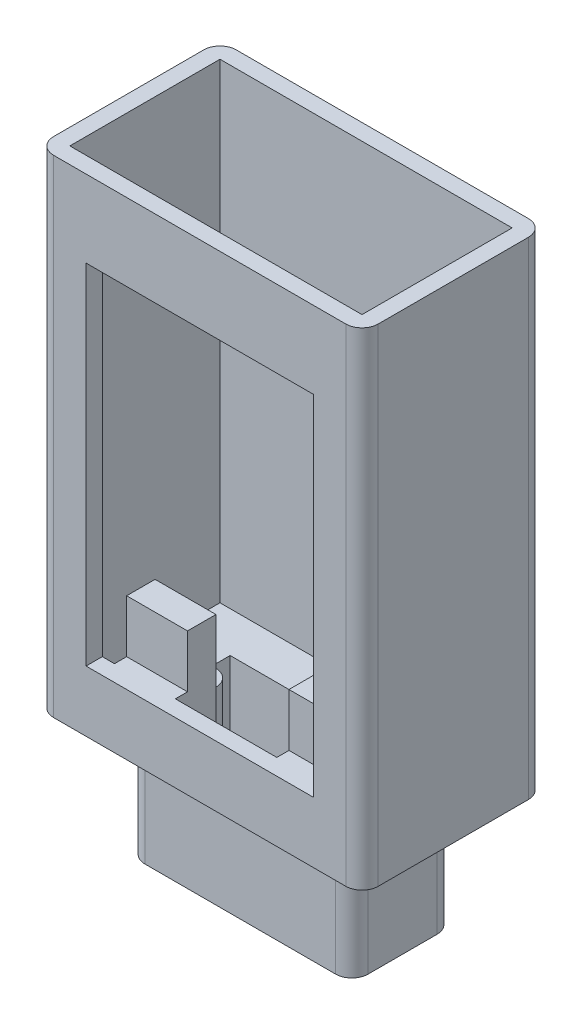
ISO-10303-21;
HEADER;
FILE_DESCRIPTION(('STEP AP214'),'2;1');
FILE_NAME('part.step','',(''),(''),'','','');
FILE_SCHEMA(('AUTOMOTIVE_DESIGN { 1 0 10303 214 1 1 1 1 }'));
ENDSEC;
DATA;
#1=APPLICATION_CONTEXT('core data for automotive mechanical design processes');
#2=APPLICATION_PROTOCOL_DEFINITION('international standard','automotive_design',2000,#1);
#3=PRODUCT_CONTEXT('',#1,'mechanical');
#4=PRODUCT('Part','Part','',(#3));
#5=PRODUCT_RELATED_PRODUCT_CATEGORY('part','',(#4));
#6=PRODUCT_DEFINITION_FORMATION('','',#4);
#7=PRODUCT_DEFINITION_CONTEXT('part definition',#1,'design');
#8=PRODUCT_DEFINITION('design','',#6,#7);
#9=PRODUCT_DEFINITION_SHAPE('','',#8);
#10=(LENGTH_UNIT() NAMED_UNIT(*) SI_UNIT(.MILLI.,.METRE.));
#11=(NAMED_UNIT(*) PLANE_ANGLE_UNIT() SI_UNIT($,.RADIAN.));
#12=(NAMED_UNIT(*) SI_UNIT($,.STERADIAN.) SOLID_ANGLE_UNIT());
#13=UNCERTAINTY_MEASURE_WITH_UNIT(LENGTH_MEASURE(1.E-05),#10,'distance_accuracy_value','');
#14=(GEOMETRIC_REPRESENTATION_CONTEXT(3) GLOBAL_UNCERTAINTY_ASSIGNED_CONTEXT((#13)) GLOBAL_UNIT_ASSIGNED_CONTEXT((#10,
#11,#12)) REPRESENTATION_CONTEXT('',''));
#15=CARTESIAN_POINT('',(0.,0.,0.));
#16=DIRECTION('',(0.,0.,1.));
#17=DIRECTION('',(1.,0.,0.));
#18=AXIS2_PLACEMENT_3D('',#15,#16,#17);
#19=CARTESIAN_POINT('',(-28.,15.,22.5));
#20=DIRECTION('',(0.,1.,0.));
#21=DIRECTION('',(-1.,0.,0.));
#22=AXIS2_PLACEMENT_3D('',#19,#20,#21);
#23=PLANE('',#22);
#24=DIRECTION('',(0.,0.,-1.));
#25=VECTOR('',#24,1.);
#26=CARTESIAN_POINT('',(25.,15.,18.5));
#27=LINE('',#26,#25);
#28=CARTESIAN_POINT('',(25.,15.,18.5));
#29=VERTEX_POINT('',#28);
#30=CARTESIAN_POINT('',(25.,15.,15.5));
#31=VERTEX_POINT('',#30);
#32=EDGE_CURVE('E55',#29,#31,#27,.T.);
#33=ORIENTED_EDGE('',*,*,#32,.T.);
#34=DIRECTION('',(1.,0.,0.));
#35=VECTOR('',#34,1.);
#36=CARTESIAN_POINT('',(15.,15.,15.5));
#37=LINE('',#36,#35);
#38=CARTESIAN_POINT('',(15.,15.,15.5));
#39=VERTEX_POINT('',#38);
#40=EDGE_CURVE('E50',#39,#31,#37,.T.);
#41=ORIENTED_EDGE('',*,*,#40,.F.);
#42=DIRECTION('',(0.,0.,1.));
#43=VECTOR('',#42,1.);
#44=CARTESIAN_POINT('',(15.,15.,18.5));
#45=LINE('',#44,#43);
#46=CARTESIAN_POINT('',(15.,15.,18.5));
#47=VERTEX_POINT('',#46);
#48=EDGE_CURVE('E337',#39,#47,#45,.T.);
#49=ORIENTED_EDGE('',*,*,#48,.T.);
#50=DIRECTION('',(1.,0.,0.));
#51=VECTOR('',#50,1.);
#52=CARTESIAN_POINT('',(40.,15.,18.5));
#53=LINE('',#52,#51);
#54=CARTESIAN_POINT('',(-10.,15.,18.5));
#55=VERTEX_POINT('',#54);
#56=EDGE_CURVE('E619',#55,#47,#53,.T.);
#57=ORIENTED_EDGE('',*,*,#56,.F.);
#58=DIRECTION('',(0.,0.,-1.));
#59=VECTOR('',#58,1.);
#60=CARTESIAN_POINT('',(-10.,15.,18.5));
#61=LINE('',#60,#59);
#62=CARTESIAN_POINT('',(-10.,15.,15.5));
#63=VERTEX_POINT('',#62);
#64=EDGE_CURVE('E385',#55,#63,#61,.T.);
#65=ORIENTED_EDGE('',*,*,#64,.T.);
#66=DIRECTION('',(1.,0.,0.));
#67=VECTOR('',#66,1.);
#68=CARTESIAN_POINT('',(-25.,15.,15.5));
#69=LINE('',#68,#67);
#70=CARTESIAN_POINT('',(-25.,15.,15.5));
#71=VERTEX_POINT('',#70);
#72=EDGE_CURVE('E338',#71,#63,#69,.T.);
#73=ORIENTED_EDGE('',*,*,#72,.F.);
#74=DIRECTION('',(0.,0.,1.));
#75=VECTOR('',#74,1.);
#76=CARTESIAN_POINT('',(-25.,15.,18.5));
#77=LINE('',#76,#75);
#78=CARTESIAN_POINT('',(-25.,15.,18.5));
#79=VERTEX_POINT('',#78);
#80=EDGE_CURVE('E383',#71,#79,#77,.T.);
#81=ORIENTED_EDGE('',*,*,#80,.T.);
#82=CARTESIAN_POINT('',(-28.,15.,18.5));
#83=VERTEX_POINT('',#82);
#84=EDGE_CURVE('E615',#83,#79,#53,.T.);
#85=ORIENTED_EDGE('',*,*,#84,.F.);
#86=DIRECTION('',(0.,0.,-1.));
#87=VECTOR('',#86,1.);
#88=CARTESIAN_POINT('',(-28.,15.,22.5));
#89=LINE('',#88,#87);
#90=CARTESIAN_POINT('',(-28.,15.,22.5));
#91=VERTEX_POINT('',#90);
#92=EDGE_CURVE('E418',#91,#83,#89,.T.);
#93=ORIENTED_EDGE('',*,*,#92,.F.);
#94=DIRECTION('',(1.,0.,0.));
#95=VECTOR('',#94,1.);
#96=CARTESIAN_POINT('',(-28.,15.,22.5));
#97=LINE('',#96,#95);
#98=CARTESIAN_POINT('',(28.,15.,22.5));
#99=VERTEX_POINT('',#98);
#100=EDGE_CURVE('E413',#91,#99,#97,.T.);
#101=ORIENTED_EDGE('',*,*,#100,.T.);
#102=DIRECTION('',(0.,0.,-1.));
#103=VECTOR('',#102,1.);
#104=CARTESIAN_POINT('',(28.,15.,22.5));
#105=LINE('',#104,#103);
#106=CARTESIAN_POINT('',(28.,15.,18.5));
#107=VERTEX_POINT('',#106);
#108=EDGE_CURVE('E415',#99,#107,#105,.T.);
#109=ORIENTED_EDGE('',*,*,#108,.T.);
#110=EDGE_CURVE('E610',#29,#107,#53,.T.);
#111=ORIENTED_EDGE('',*,*,#110,.F.);
#112=EDGE_LOOP('',(#33,#41,#49,#57,#65,#73,#81,#85,#93,#101,#109,#111));
#113=FACE_BOUND('',#112,.T.);
#114=ADVANCED_FACE('F35',(#113),#23,.T.);
#115=CARTESIAN_POINT('',(40.,120.,18.5));
#116=DIRECTION('',(0.,0.,-1.));
#117=DIRECTION('',(-1.,0.,0.));
#118=AXIS2_PLACEMENT_3D('',#115,#116,#117);
#119=PLANE('',#118);
#120=ORIENTED_EDGE('',*,*,#56,.T.);
#121=DIRECTION('',(0.,-1.,0.));
#122=VECTOR('',#121,1.);
#123=CARTESIAN_POINT('',(15.,15.,18.5));
#124=LINE('',#123,#122);
#125=CARTESIAN_POINT('',(15.,4.,18.5));
#126=VERTEX_POINT('',#125);
#127=EDGE_CURVE('E380',#47,#126,#124,.T.);
#128=ORIENTED_EDGE('',*,*,#127,.T.);
#129=DIRECTION('',(1.,0.,0.));
#130=VECTOR('',#129,1.);
#131=CARTESIAN_POINT('',(40.,4.,18.5));
#132=LINE('',#131,#130);
#133=CARTESIAN_POINT('',(-10.,4.,18.5));
#134=VERTEX_POINT('',#133);
#135=EDGE_CURVE('E461',#134,#126,#132,.T.);
#136=ORIENTED_EDGE('',*,*,#135,.F.);
#137=DIRECTION('',(0.,-1.,0.));
#138=VECTOR('',#137,1.);
#139=CARTESIAN_POINT('',(-10.,15.,18.5));
#140=LINE('',#139,#138);
#141=EDGE_CURVE('E401',#55,#134,#140,.T.);
#142=ORIENTED_EDGE('',*,*,#141,.F.);
#143=EDGE_LOOP('',(#120,#128,#136,#142));
#144=FACE_BOUND('',#143,.T.);
#145=ADVANCED_FACE('F710',(#144),#119,.T.);
#146=CARTESIAN_POINT('',(25.,4.,18.5));
#147=VERTEX_POINT('',#146);
#148=CARTESIAN_POINT('',(36.,4.,18.5));
#149=VERTEX_POINT('',#148);
#150=EDGE_CURVE('E451',#147,#149,#132,.T.);
#151=ORIENTED_EDGE('',*,*,#150,.F.);
#152=DIRECTION('',(0.,-1.,0.));
#153=VECTOR('',#152,1.);
#154=CARTESIAN_POINT('',(25.,15.,18.5));
#155=LINE('',#154,#153);
#156=EDGE_CURVE('E377',#29,#147,#155,.T.);
#157=ORIENTED_EDGE('',*,*,#156,.F.);
#158=ORIENTED_EDGE('',*,*,#110,.T.);
#159=DIRECTION('',(0.,1.,0.));
#160=VECTOR('',#159,1.);
#161=CARTESIAN_POINT('',(28.,120.,18.5));
#162=LINE('',#161,#160);
#163=CARTESIAN_POINT('',(28.,101.,18.5));
#164=VERTEX_POINT('',#163);
#165=EDGE_CURVE('E625',#107,#164,#162,.T.);
#166=ORIENTED_EDGE('',*,*,#165,.T.);
#167=DIRECTION('',(-1.,0.,0.));
#168=VECTOR('',#167,1.);
#169=CARTESIAN_POINT('',(40.,101.,18.5));
#170=LINE('',#169,#168);
#171=CARTESIAN_POINT('',(-28.,101.,18.5));
#172=VERTEX_POINT('',#171);
#173=EDGE_CURVE('E622',#164,#172,#170,.T.);
#174=ORIENTED_EDGE('',*,*,#173,.T.);
#175=DIRECTION('',(0.,-1.,0.));
#176=VECTOR('',#175,1.);
#177=CARTESIAN_POINT('',(-28.,120.,18.5));
#178=LINE('',#177,#176);
#179=EDGE_CURVE('E618',#172,#83,#178,.T.);
#180=ORIENTED_EDGE('',*,*,#179,.T.);
#181=ORIENTED_EDGE('',*,*,#84,.T.);
#182=DIRECTION('',(0.,-1.,0.));
#183=VECTOR('',#182,1.);
#184=CARTESIAN_POINT('',(-25.,15.,18.5));
#185=LINE('',#184,#183);
#186=CARTESIAN_POINT('',(-25.,4.,18.5));
#187=VERTEX_POINT('',#186);
#188=EDGE_CURVE('E404',#79,#187,#185,.T.);
#189=ORIENTED_EDGE('',*,*,#188,.T.);
#190=CARTESIAN_POINT('',(-36.,4.,18.5));
#191=VERTEX_POINT('',#190);
#192=EDGE_CURVE('E458',#191,#187,#132,.T.);
#193=ORIENTED_EDGE('',*,*,#192,.F.);
#194=DIRECTION('',(0.,-1.,0.));
#195=VECTOR('',#194,1.);
#196=CARTESIAN_POINT('',(-36.,120.,18.5));
#197=LINE('',#196,#195);
#198=CARTESIAN_POINT('',(-36.,120.,18.5));
#199=VERTEX_POINT('',#198);
#200=EDGE_CURVE('E474',#199,#191,#197,.T.);
#201=ORIENTED_EDGE('',*,*,#200,.F.);
#202=DIRECTION('',(1.,0.,0.));
#203=VECTOR('',#202,1.);
#204=CARTESIAN_POINT('',(40.,120.,18.5));
#205=LINE('',#204,#203);
#206=CARTESIAN_POINT('',(36.,120.,18.5));
#207=VERTEX_POINT('',#206);
#208=EDGE_CURVE('E500',#199,#207,#205,.T.);
#209=ORIENTED_EDGE('',*,*,#208,.T.);
#210=DIRECTION('',(0.,-1.,0.));
#211=VECTOR('',#210,1.);
#212=CARTESIAN_POINT('',(36.,120.,18.5));
#213=LINE('',#212,#211);
#214=EDGE_CURVE('E478',#207,#149,#213,.T.);
#215=ORIENTED_EDGE('',*,*,#214,.T.);
#216=EDGE_LOOP('',(#151,#157,#158,#166,#174,#180,#181,#189,#193,#201,#209,#215));
#217=FACE_BOUND('',#216,.T.);
#218=ADVANCED_FACE('F715',(#217),#119,.T.);
#219=CARTESIAN_POINT('',(0.,4.,0.));
#220=DIRECTION('',(0.,1.,0.));
#221=DIRECTION('',(0.,0.,1.));
#222=AXIS2_PLACEMENT_3D('',#219,#220,#221);
#223=PLANE('',#222);
#224=ORIENTED_EDGE('',*,*,#135,.T.);
#225=DIRECTION('',(0.,0.,1.));
#226=VECTOR('',#225,1.);
#227=CARTESIAN_POINT('',(15.,4.,18.5));
#228=LINE('',#227,#226);
#229=CARTESIAN_POINT('',(15.,4.,8.5));
#230=VERTEX_POINT('',#229);
#231=EDGE_CURVE('E362',#230,#126,#228,.T.);
#232=ORIENTED_EDGE('',*,*,#231,.F.);
#233=DIRECTION('',(-1.,0.,0.));
#234=VECTOR('',#233,1.);
#235=CARTESIAN_POINT('',(0.,4.,8.5));
#236=LINE('',#235,#234);
#237=CARTESIAN_POINT('',(-10.,4.,8.5));
#238=VERTEX_POINT('',#237);
#239=EDGE_CURVE('E466',#230,#238,#236,.T.);
#240=ORIENTED_EDGE('',*,*,#239,.T.);
#241=DIRECTION('',(0.,0.,-1.));
#242=VECTOR('',#241,1.);
#243=CARTESIAN_POINT('',(-10.,4.,18.5));
#244=LINE('',#243,#242);
#245=EDGE_CURVE('E391',#134,#238,#244,.T.);
#246=ORIENTED_EDGE('',*,*,#245,.F.);
#247=EDGE_LOOP('',(#224,#232,#240,#246));
#248=FACE_BOUND('',#247,.T.);
#249=ADVANCED_FACE('F751',(#248),#223,.T.);
#250=CARTESIAN_POINT('',(-22.5,4.,0.));
#251=DIRECTION('',(0.,1.,0.));
#252=DIRECTION('',(0.,0.,1.));
#253=AXIS2_PLACEMENT_3D('',#250,#251,#252);
#254=CIRCLE('',#253,1.5);
#255=CARTESIAN_POINT('',(-22.5,4.,1.5));
#256=VERTEX_POINT('',#255);
#257=EDGE_CURVE('E438',#256,#256,#254,.T.);
#258=ORIENTED_EDGE('',*,*,#257,.F.);
#259=EDGE_LOOP('',(#258));
#260=FACE_BOUND('',#259,.T.);
#261=CARTESIAN_POINT('',(22.5,4.,0.));
#262=DIRECTION('',(0.,1.,0.));
#263=DIRECTION('',(0.,0.,1.));
#264=AXIS2_PLACEMENT_3D('',#261,#262,#263);
#265=CIRCLE('',#264,1.5);
#266=CARTESIAN_POINT('',(22.5,4.,1.5));
#267=VERTEX_POINT('',#266);
#268=EDGE_CURVE('E431',#267,#267,#265,.T.);
#269=ORIENTED_EDGE('',*,*,#268,.F.);
#270=EDGE_LOOP('',(#269));
#271=FACE_BOUND('',#270,.T.);
#272=DIRECTION('',(-1.,0.,0.));
#273=VECTOR('',#272,1.);
#274=CARTESIAN_POINT('',(15.,4.,8.50000000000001));
#275=LINE('',#274,#273);
#276=CARTESIAN_POINT('',(25.,4.,8.50000000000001));
#277=VERTEX_POINT('',#276);
#278=CARTESIAN_POINT('',(23.5,4.,8.50000000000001));
#279=VERTEX_POINT('',#278);
#280=EDGE_CURVE('E364',#277,#279,#275,.T.);
#281=ORIENTED_EDGE('',*,*,#280,.F.);
#282=DIRECTION('',(0.,0.,-1.));
#283=VECTOR('',#282,1.);
#284=CARTESIAN_POINT('',(25.,4.,18.5));
#285=LINE('',#284,#283);
#286=EDGE_CURVE('E368',#147,#277,#285,.T.);
#287=ORIENTED_EDGE('',*,*,#286,.F.);
#288=ORIENTED_EDGE('',*,*,#150,.T.);
#289=DIRECTION('',(0.,0.,-1.));
#290=VECTOR('',#289,1.);
#291=CARTESIAN_POINT('',(36.,4.,22.5));
#292=LINE('',#291,#290);
#293=CARTESIAN_POINT('',(36.,4.,-18.5));
#294=VERTEX_POINT('',#293);
#295=EDGE_CURVE('E456',#149,#294,#292,.T.);
#296=ORIENTED_EDGE('',*,*,#295,.T.);
#297=DIRECTION('',(-1.,0.,0.));
#298=VECTOR('',#297,1.);
#299=CARTESIAN_POINT('',(40.,4.,-18.5));
#300=LINE('',#299,#298);
#301=CARTESIAN_POINT('',(-36.,4.,-18.5));
#302=VERTEX_POINT('',#301);
#303=EDGE_CURVE('E453',#294,#302,#300,.T.);
#304=ORIENTED_EDGE('',*,*,#303,.T.);
#305=DIRECTION('',(0.,0.,1.));
#306=VECTOR('',#305,1.);
#307=CARTESIAN_POINT('',(-36.,4.,22.5));
#308=LINE('',#307,#306);
#309=EDGE_CURVE('E448',#302,#191,#308,.T.);
#310=ORIENTED_EDGE('',*,*,#309,.T.);
#311=ORIENTED_EDGE('',*,*,#192,.T.);
#312=DIRECTION('',(0.,0.,1.));
#313=VECTOR('',#312,1.);
#314=CARTESIAN_POINT('',(-25.,4.,18.5));
#315=LINE('',#314,#313);
#316=CARTESIAN_POINT('',(-25.,4.,8.50000000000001));
#317=VERTEX_POINT('',#316);
#318=EDGE_CURVE('E382',#317,#187,#315,.T.);
#319=ORIENTED_EDGE('',*,*,#318,.F.);
#320=DIRECTION('',(-1.,0.,0.));
#321=VECTOR('',#320,1.);
#322=CARTESIAN_POINT('',(-25.,4.,8.50000000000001));
#323=LINE('',#322,#321);
#324=CARTESIAN_POINT('',(-23.5,4.,8.5));
#325=VERTEX_POINT('',#324);
#326=EDGE_CURVE('E386',#325,#317,#323,.T.);
#327=ORIENTED_EDGE('',*,*,#326,.F.);
#328=DIRECTION('',(0.,0.,-1.));
#329=VECTOR('',#328,1.);
#330=CARTESIAN_POINT('',(-23.5,4.,0.));
#331=LINE('',#330,#329);
#332=CARTESIAN_POINT('',(-23.5,4.,3.87298334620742));
#333=VERTEX_POINT('',#332);
#334=EDGE_CURVE('E462',#325,#333,#331,.T.);
#335=ORIENTED_EDGE('',*,*,#334,.T.);
#336=CARTESIAN_POINT('',(-22.5,4.,0.));
#337=DIRECTION('',(0.,1.,0.));
#338=DIRECTION('',(0.,0.,1.));
#339=AXIS2_PLACEMENT_3D('',#336,#337,#338);
#340=CIRCLE('',#339,4.);
#341=CARTESIAN_POINT('',(-23.5,4.,-3.87298334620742));
#342=VERTEX_POINT('',#341);
#343=EDGE_CURVE('E444',#342,#333,#340,.F.);
#344=ORIENTED_EDGE('',*,*,#343,.F.);
#345=CARTESIAN_POINT('',(-23.5,4.,-8.5));
#346=VERTEX_POINT('',#345);
#347=EDGE_CURVE('E447',#342,#346,#331,.T.);
#348=ORIENTED_EDGE('',*,*,#347,.T.);
#349=DIRECTION('',(1.,0.,0.));
#350=VECTOR('',#349,1.);
#351=CARTESIAN_POINT('',(0.,4.,-8.5));
#352=LINE('',#351,#350);
#353=CARTESIAN_POINT('',(23.5,4.,-8.49999999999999));
#354=VERTEX_POINT('',#353);
#355=EDGE_CURVE('E465',#346,#354,#352,.T.);
#356=ORIENTED_EDGE('',*,*,#355,.T.);
#357=DIRECTION('',(0.,0.,1.));
#358=VECTOR('',#357,1.);
#359=CARTESIAN_POINT('',(23.5,4.,0.));
#360=LINE('',#359,#358);
#361=CARTESIAN_POINT('',(23.5,4.,-3.87298334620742));
#362=VERTEX_POINT('',#361);
#363=EDGE_CURVE('E469',#354,#362,#360,.T.);
#364=ORIENTED_EDGE('',*,*,#363,.T.);
#365=CARTESIAN_POINT('',(22.5,4.,0.));
#366=DIRECTION('',(0.,1.,0.));
#367=DIRECTION('',(0.,0.,1.));
#368=AXIS2_PLACEMENT_3D('',#365,#366,#367);
#369=CIRCLE('',#368,4.);
#370=CARTESIAN_POINT('',(23.5,4.,3.87298334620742));
#371=VERTEX_POINT('',#370);
#372=EDGE_CURVE('E437',#371,#362,#369,.F.);
#373=ORIENTED_EDGE('',*,*,#372,.F.);
#374=EDGE_CURVE('E472',#371,#279,#360,.T.);
#375=ORIENTED_EDGE('',*,*,#374,.T.);
#376=EDGE_LOOP('',(#281,#287,#288,#296,#304,#310,#311,#319,#327,#335,#344,#348,#356,#364,#373,#375));
#377=FACE_BOUND('',#376,.T.);
#378=ADVANCED_FACE('F754',(#260,#271,#377),#223,.T.);
#379=CARTESIAN_POINT('',(40.,120.,22.5));
#380=DIRECTION('',(0.,0.,-1.));
#381=DIRECTION('',(-1.,0.,0.));
#382=AXIS2_PLACEMENT_3D('',#379,#380,#381);
#383=PLANE('',#382);
#384=DIRECTION('',(1.,0.,0.));
#385=VECTOR('',#384,1.);
#386=CARTESIAN_POINT('',(40.,120.,22.5));
#387=LINE('',#386,#385);
#388=CARTESIAN_POINT('',(-36.,120.,22.5));
#389=VERTEX_POINT('',#388);
#390=CARTESIAN_POINT('',(36.,120.,22.5));
#391=VERTEX_POINT('',#390);
#392=EDGE_CURVE('E542',#389,#391,#387,.T.);
#393=ORIENTED_EDGE('',*,*,#392,.F.);
#394=DIRECTION('',(0.,-1.,0.));
#395=VECTOR('',#394,1.);
#396=CARTESIAN_POINT('',(-36.,120.,22.5));
#397=LINE('',#396,#395);
#398=CARTESIAN_POINT('',(-36.,0.,22.5));
#399=VERTEX_POINT('',#398);
#400=EDGE_CURVE('E656',#389,#399,#397,.T.);
#401=ORIENTED_EDGE('',*,*,#400,.T.);
#402=DIRECTION('',(1.,0.,0.));
#403=VECTOR('',#402,1.);
#404=CARTESIAN_POINT('',(40.,0.,22.5));
#405=LINE('',#404,#403);
#406=CARTESIAN_POINT('',(36.,0.,22.5));
#407=VERTEX_POINT('',#406);
#408=EDGE_CURVE('E555',#399,#407,#405,.T.);
#409=ORIENTED_EDGE('',*,*,#408,.T.);
#410=DIRECTION('',(0.,-1.,0.));
#411=VECTOR('',#410,1.);
#412=CARTESIAN_POINT('',(36.,120.,22.5));
#413=LINE('',#412,#411);
#414=EDGE_CURVE('E654',#407,#391,#413,.F.);
#415=ORIENTED_EDGE('',*,*,#414,.T.);
#416=EDGE_LOOP('',(#393,#401,#409,#415));
#417=FACE_BOUND('',#416,.T.);
#418=DIRECTION('',(0.,1.,0.));
#419=VECTOR('',#418,1.);
#420=CARTESIAN_POINT('',(28.,15.,22.5));
#421=LINE('',#420,#419);
#422=CARTESIAN_POINT('',(28.,101.,22.5));
#423=VERTEX_POINT('',#422);
#424=EDGE_CURVE('E406',#99,#423,#421,.T.);
#425=ORIENTED_EDGE('',*,*,#424,.F.);
#426=ORIENTED_EDGE('',*,*,#100,.F.);
#427=DIRECTION('',(0.,-1.,0.));
#428=VECTOR('',#427,1.);
#429=CARTESIAN_POINT('',(-28.,15.,22.5));
#430=LINE('',#429,#428);
#431=CARTESIAN_POINT('',(-28.,101.,22.5));
#432=VERTEX_POINT('',#431);
#433=EDGE_CURVE('E410',#432,#91,#430,.T.);
#434=ORIENTED_EDGE('',*,*,#433,.F.);
#435=DIRECTION('',(-1.,0.,0.));
#436=VECTOR('',#435,1.);
#437=CARTESIAN_POINT('',(-28.,101.,22.5));
#438=LINE('',#437,#436);
#439=EDGE_CURVE('E408',#423,#432,#438,.T.);
#440=ORIENTED_EDGE('',*,*,#439,.F.);
#441=EDGE_LOOP('',(#425,#426,#434,#440));
#442=FACE_BOUND('',#441,.T.);
#443=ADVANCED_FACE('F697',(#417,#442),#383,.F.);
#444=CARTESIAN_POINT('',(23.5,-30.,-12.5));
#445=DIRECTION('',(-1.,0.,0.));
#446=DIRECTION('',(0.,0.,1.));
#447=AXIS2_PLACEMENT_3D('',#444,#445,#446);
#448=PLANE('',#447);
#449=DIRECTION('',(0.,-1.,0.));
#450=VECTOR('',#449,1.);
#451=CARTESIAN_POINT('',(23.5,15.3137084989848,-3.87298334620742));
#452=LINE('',#451,#450);
#453=CARTESIAN_POINT('',(23.5,-30.,-3.87298334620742));
#454=VERTEX_POINT('',#453);
#455=EDGE_CURVE('E607',#362,#454,#452,.T.);
#456=ORIENTED_EDGE('',*,*,#455,.F.);
#457=ORIENTED_EDGE('',*,*,#363,.F.);
#458=DIRECTION('',(0.,-1.,0.));
#459=VECTOR('',#458,1.);
#460=CARTESIAN_POINT('',(23.5,-30.,-8.49999999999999));
#461=LINE('',#460,#459);
#462=CARTESIAN_POINT('',(23.5,-30.,-8.49999999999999));
#463=VERTEX_POINT('',#462);
#464=EDGE_CURVE('E495',#354,#463,#461,.T.);
#465=ORIENTED_EDGE('',*,*,#464,.T.);
#466=DIRECTION('',(0.,0.,1.));
#467=VECTOR('',#466,1.);
#468=CARTESIAN_POINT('',(23.5,-30.,-12.5));
#469=LINE('',#468,#467);
#470=EDGE_CURVE('E512',#463,#454,#469,.T.);
#471=ORIENTED_EDGE('',*,*,#470,.T.);
#472=EDGE_LOOP('',(#456,#457,#465,#471));
#473=FACE_BOUND('',#472,.T.);
#474=ADVANCED_FACE('F782',(#473),#448,.T.);
#475=CARTESIAN_POINT('',(-23.5,-30.,-12.5));
#476=DIRECTION('',(1.,0.,0.));
#477=DIRECTION('',(0.,0.,-1.));
#478=AXIS2_PLACEMENT_3D('',#475,#476,#477);
#479=PLANE('',#478);
#480=DIRECTION('',(0.,-1.,0.));
#481=VECTOR('',#480,1.);
#482=CARTESIAN_POINT('',(-23.5,15.3137084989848,3.87298334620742));
#483=LINE('',#482,#481);
#484=CARTESIAN_POINT('',(-23.5,-30.,3.87298334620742));
#485=VERTEX_POINT('',#484);
#486=EDGE_CURVE('E601',#333,#485,#483,.T.);
#487=ORIENTED_EDGE('',*,*,#486,.F.);
#488=ORIENTED_EDGE('',*,*,#334,.F.);
#489=DIRECTION('',(0.,-1.,0.));
#490=VECTOR('',#489,1.);
#491=CARTESIAN_POINT('',(-23.5,-30.,8.5));
#492=LINE('',#491,#490);
#493=CARTESIAN_POINT('',(-23.5,-30.,8.5));
#494=VERTEX_POINT('',#493);
#495=EDGE_CURVE('E492',#325,#494,#492,.T.);
#496=ORIENTED_EDGE('',*,*,#495,.T.);
#497=DIRECTION('',(0.,0.,-1.));
#498=VECTOR('',#497,1.);
#499=CARTESIAN_POINT('',(-23.5,-30.,-12.5));
#500=LINE('',#499,#498);
#501=EDGE_CURVE('E506',#494,#485,#500,.T.);
#502=ORIENTED_EDGE('',*,*,#501,.T.);
#503=EDGE_LOOP('',(#487,#488,#496,#502));
#504=FACE_BOUND('',#503,.T.);
#505=ADVANCED_FACE('F774',(#504),#479,.T.);
#506=CARTESIAN_POINT('',(0.,0.,0.));
#507=DIRECTION('',(0.,1.,0.));
#508=DIRECTION('',(0.,0.,1.));
#509=AXIS2_PLACEMENT_3D('',#506,#507,#508);
#510=PLANE('',#509);
#511=DIRECTION('',(0.,0.,1.));
#512=VECTOR('',#511,1.);
#513=CARTESIAN_POINT('',(-40.,0.,22.5));
#514=LINE('',#513,#512);
#515=CARTESIAN_POINT('',(-40.,0.,-18.5));
#516=VERTEX_POINT('',#515);
#517=CARTESIAN_POINT('',(-40.,0.,18.5));
#518=VERTEX_POINT('',#517);
#519=EDGE_CURVE('E528',#516,#518,#514,.T.);
#520=ORIENTED_EDGE('',*,*,#519,.F.);
#521=CARTESIAN_POINT('',(-36.,0.,-18.5));
#522=DIRECTION('',(0.,1.,0.));
#523=DIRECTION('',(0.,0.,1.));
#524=AXIS2_PLACEMENT_3D('',#521,#522,#523);
#525=CIRCLE('',#524,4.);
#526=CARTESIAN_POINT('',(-36.,0.,-22.5));
#527=VERTEX_POINT('',#526);
#528=EDGE_CURVE('E639',#516,#527,#525,.F.);
#529=ORIENTED_EDGE('',*,*,#528,.T.);
#530=DIRECTION('',(-1.,0.,0.));
#531=VECTOR('',#530,1.);
#532=CARTESIAN_POINT('',(40.,0.,-22.5));
#533=LINE('',#532,#531);
#534=CARTESIAN_POINT('',(36.,0.,-22.5));
#535=VERTEX_POINT('',#534);
#536=EDGE_CURVE('E543',#535,#527,#533,.T.);
#537=ORIENTED_EDGE('',*,*,#536,.F.);
#538=CARTESIAN_POINT('',(36.,0.,-18.5));
#539=DIRECTION('',(0.,1.,0.));
#540=DIRECTION('',(0.,0.,1.));
#541=AXIS2_PLACEMENT_3D('',#538,#539,#540);
#542=CIRCLE('',#541,4.);
#543=CARTESIAN_POINT('',(40.,0.,-18.5));
#544=VERTEX_POINT('',#543);
#545=EDGE_CURVE('E635',#535,#544,#542,.F.);
#546=ORIENTED_EDGE('',*,*,#545,.T.);
#547=DIRECTION('',(0.,0.,-1.));
#548=VECTOR('',#547,1.);
#549=CARTESIAN_POINT('',(40.,0.,22.5));
#550=LINE('',#549,#548);
#551=CARTESIAN_POINT('',(40.,0.,18.5));
#552=VERTEX_POINT('',#551);
#553=EDGE_CURVE('E558',#552,#544,#550,.T.);
#554=ORIENTED_EDGE('',*,*,#553,.F.);
#555=CARTESIAN_POINT('',(36.,0.,18.5));
#556=DIRECTION('',(0.,1.,0.));
#557=DIRECTION('',(0.,0.,1.));
#558=AXIS2_PLACEMENT_3D('',#555,#556,#557);
#559=CIRCLE('',#558,4.);
#560=EDGE_CURVE('E633',#552,#407,#559,.F.);
#561=ORIENTED_EDGE('',*,*,#560,.T.);
#562=ORIENTED_EDGE('',*,*,#408,.F.);
#563=CARTESIAN_POINT('',(-36.,0.,18.5));
#564=DIRECTION('',(0.,1.,0.));
#565=DIRECTION('',(0.,0.,1.));
#566=AXIS2_PLACEMENT_3D('',#563,#564,#565);
#567=CIRCLE('',#566,4.);
#568=EDGE_CURVE('E637',#399,#518,#567,.F.);
#569=ORIENTED_EDGE('',*,*,#568,.T.);
#570=EDGE_LOOP('',(#520,#529,#537,#546,#554,#561,#562,#569));
#571=FACE_BOUND('',#570,.T.);
#572=DIRECTION('',(0.,0.,-1.));
#573=VECTOR('',#572,1.);
#574=CARTESIAN_POINT('',(-27.5,0.,-12.5));
#575=LINE('',#574,#573);
#576=CARTESIAN_POINT('',(-27.5,0.,8.5));
#577=VERTEX_POINT('',#576);
#578=CARTESIAN_POINT('',(-27.5,0.,-8.5));
#579=VERTEX_POINT('',#578);
#580=EDGE_CURVE('E491',#577,#579,#575,.T.);
#581=ORIENTED_EDGE('',*,*,#580,.F.);
#582=CARTESIAN_POINT('',(-23.5,0.,8.5));
#583=DIRECTION('',(0.,1.,0.));
#584=DIRECTION('',(0.,0.,1.));
#585=AXIS2_PLACEMENT_3D('',#582,#583,#584);
#586=CIRCLE('',#585,4.);
#587=CARTESIAN_POINT('',(-23.5,0.,12.5));
#588=VERTEX_POINT('',#587);
#589=EDGE_CURVE('E596',#577,#588,#586,.T.);
#590=ORIENTED_EDGE('',*,*,#589,.T.);
#591=DIRECTION('',(-1.,0.,0.));
#592=VECTOR('',#591,1.);
#593=CARTESIAN_POINT('',(27.5,0.,12.5));
#594=LINE('',#593,#592);
#595=CARTESIAN_POINT('',(23.5,0.,12.5));
#596=VERTEX_POINT('',#595);
#597=EDGE_CURVE('E519',#596,#588,#594,.T.);
#598=ORIENTED_EDGE('',*,*,#597,.F.);
#599=CARTESIAN_POINT('',(23.5,0.,8.50000000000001));
#600=DIRECTION('',(0.,1.,0.));
#601=DIRECTION('',(0.,0.,1.));
#602=AXIS2_PLACEMENT_3D('',#599,#600,#601);
#603=CIRCLE('',#602,4.);
#604=CARTESIAN_POINT('',(27.5,0.,8.50000000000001));
#605=VERTEX_POINT('',#604);
#606=EDGE_CURVE('E592',#596,#605,#603,.T.);
#607=ORIENTED_EDGE('',*,*,#606,.T.);
#608=DIRECTION('',(0.,0.,1.));
#609=VECTOR('',#608,1.);
#610=CARTESIAN_POINT('',(27.5,0.,-12.5));
#611=LINE('',#610,#609);
#612=CARTESIAN_POINT('',(27.5,0.,-8.5));
#613=VERTEX_POINT('',#612);
#614=EDGE_CURVE('E534',#613,#605,#611,.T.);
#615=ORIENTED_EDGE('',*,*,#614,.F.);
#616=CARTESIAN_POINT('',(23.5,0.,-8.5));
#617=DIRECTION('',(0.,1.,0.));
#618=DIRECTION('',(0.,0.,1.));
#619=AXIS2_PLACEMENT_3D('',#616,#617,#618);
#620=CIRCLE('',#619,4.);
#621=CARTESIAN_POINT('',(23.5,0.,-12.5));
#622=VERTEX_POINT('',#621);
#623=EDGE_CURVE('E590',#613,#622,#620,.T.);
#624=ORIENTED_EDGE('',*,*,#623,.T.);
#625=DIRECTION('',(1.,0.,0.));
#626=VECTOR('',#625,1.);
#627=CARTESIAN_POINT('',(27.5,0.,-12.5));
#628=LINE('',#627,#626);
#629=CARTESIAN_POINT('',(-23.5,0.,-12.5));
#630=VERTEX_POINT('',#629);
#631=EDGE_CURVE('E531',#630,#622,#628,.T.);
#632=ORIENTED_EDGE('',*,*,#631,.F.);
#633=CARTESIAN_POINT('',(-23.5,0.,-8.5));
#634=DIRECTION('',(0.,1.,0.));
#635=DIRECTION('',(0.,0.,1.));
#636=AXIS2_PLACEMENT_3D('',#633,#634,#635);
#637=CIRCLE('',#636,4.);
#638=EDGE_CURVE('E594',#630,#579,#637,.T.);
#639=ORIENTED_EDGE('',*,*,#638,.T.);
#640=EDGE_LOOP('',(#581,#590,#598,#607,#615,#624,#632,#639));
#641=FACE_BOUND('',#640,.T.);
#642=ADVANCED_FACE('F669',(#571,#641),#510,.F.);
#643=CARTESIAN_POINT('',(-40.,120.,22.5));
#644=DIRECTION('',(1.,0.,0.));
#645=DIRECTION('',(0.,0.,-1.));
#646=AXIS2_PLACEMENT_3D('',#643,#644,#645);
#647=PLANE('',#646);
#648=DIRECTION('',(0.,0.,1.));
#649=VECTOR('',#648,1.);
#650=CARTESIAN_POINT('',(-40.,120.,22.5));
#651=LINE('',#650,#649);
#652=CARTESIAN_POINT('',(-40.,120.,-18.5));
#653=VERTEX_POINT('',#652);
#654=CARTESIAN_POINT('',(-40.,120.,18.5));
#655=VERTEX_POINT('',#654);
#656=EDGE_CURVE('E539',#653,#655,#651,.T.);
#657=ORIENTED_EDGE('',*,*,#656,.F.);
#658=DIRECTION('',(0.,-1.,0.));
#659=VECTOR('',#658,1.);
#660=CARTESIAN_POINT('',(-40.,120.,-18.5));
#661=LINE('',#660,#659);
#662=EDGE_CURVE('E630',#653,#516,#661,.T.);
#663=ORIENTED_EDGE('',*,*,#662,.T.);
#664=ORIENTED_EDGE('',*,*,#519,.T.);
#665=DIRECTION('',(0.,-1.,0.));
#666=VECTOR('',#665,1.);
#667=CARTESIAN_POINT('',(-40.,120.,18.5));
#668=LINE('',#667,#666);
#669=EDGE_CURVE('E628',#518,#655,#668,.F.);
#670=ORIENTED_EDGE('',*,*,#669,.T.);
#671=EDGE_LOOP('',(#657,#663,#664,#670));
#672=FACE_BOUND('',#671,.T.);
#673=ADVANCED_FACE('F689',(#672),#647,.F.);
#674=CARTESIAN_POINT('',(40.,120.,22.5));
#675=DIRECTION('',(-1.,0.,0.));
#676=DIRECTION('',(0.,0.,1.));
#677=AXIS2_PLACEMENT_3D('',#674,#675,#676);
#678=PLANE('',#677);
#679=ORIENTED_EDGE('',*,*,#553,.T.);
#680=DIRECTION('',(0.,-1.,0.));
#681=VECTOR('',#680,1.);
#682=CARTESIAN_POINT('',(40.,120.,-18.5));
#683=LINE('',#682,#681);
#684=CARTESIAN_POINT('',(40.,120.,-18.5));
#685=VERTEX_POINT('',#684);
#686=EDGE_CURVE('E11',#544,#685,#683,.F.);
#687=ORIENTED_EDGE('',*,*,#686,.T.);
#688=DIRECTION('',(0.,0.,-1.));
#689=VECTOR('',#688,1.);
#690=CARTESIAN_POINT('',(40.,120.,22.5));
#691=LINE('',#690,#689);
#692=CARTESIAN_POINT('',(40.,120.,18.5));
#693=VERTEX_POINT('',#692);
#694=EDGE_CURVE('E546',#693,#685,#691,.T.);
#695=ORIENTED_EDGE('',*,*,#694,.F.);
#696=DIRECTION('',(0.,-1.,0.));
#697=VECTOR('',#696,1.);
#698=CARTESIAN_POINT('',(40.,120.,18.5));
#699=LINE('',#698,#697);
#700=EDGE_CURVE('E43',#693,#552,#699,.T.);
#701=ORIENTED_EDGE('',*,*,#700,.T.);
#702=EDGE_LOOP('',(#679,#687,#695,#701));
#703=FACE_BOUND('',#702,.T.);
#704=ADVANCED_FACE('F663',(#703),#678,.F.);
#705=CARTESIAN_POINT('',(40.,120.,-22.5));
#706=DIRECTION('',(0.,0.,1.));
#707=DIRECTION('',(1.,0.,0.));
#708=AXIS2_PLACEMENT_3D('',#705,#706,#707);
#709=PLANE('',#708);
#710=ORIENTED_EDGE('',*,*,#536,.T.);
#711=DIRECTION('',(0.,-1.,0.));
#712=VECTOR('',#711,1.);
#713=CARTESIAN_POINT('',(-36.,120.,-22.5));
#714=LINE('',#713,#712);
#715=CARTESIAN_POINT('',(-36.,120.,-22.5));
#716=VERTEX_POINT('',#715);
#717=EDGE_CURVE('E644',#527,#716,#714,.F.);
#718=ORIENTED_EDGE('',*,*,#717,.T.);
#719=DIRECTION('',(-1.,0.,0.));
#720=VECTOR('',#719,1.);
#721=CARTESIAN_POINT('',(40.,120.,-22.5));
#722=LINE('',#721,#720);
#723=CARTESIAN_POINT('',(36.,120.,-22.5));
#724=VERTEX_POINT('',#723);
#725=EDGE_CURVE('E549',#724,#716,#722,.T.);
#726=ORIENTED_EDGE('',*,*,#725,.F.);
#727=DIRECTION('',(0.,-1.,0.));
#728=VECTOR('',#727,1.);
#729=CARTESIAN_POINT('',(36.,120.,-22.5));
#730=LINE('',#729,#728);
#731=EDGE_CURVE('E641',#724,#535,#730,.T.);
#732=ORIENTED_EDGE('',*,*,#731,.T.);
#733=EDGE_LOOP('',(#710,#718,#726,#732));
#734=FACE_BOUND('',#733,.T.);
#735=ADVANCED_FACE('F679',(#734),#709,.F.);
#736=CARTESIAN_POINT('',(0.,120.,0.));
#737=DIRECTION('',(0.,1.,0.));
#738=DIRECTION('',(0.,0.,1.));
#739=AXIS2_PLACEMENT_3D('',#736,#737,#738);
#740=PLANE('',#739);
#741=DIRECTION('',(0.,0.,1.));
#742=VECTOR('',#741,1.);
#743=CARTESIAN_POINT('',(-36.,120.,22.5));
#744=LINE('',#743,#742);
#745=CARTESIAN_POINT('',(-36.,120.,-18.5));
#746=VERTEX_POINT('',#745);
#747=EDGE_CURVE('E455',#746,#199,#744,.T.);
#748=ORIENTED_EDGE('',*,*,#747,.F.);
#749=DIRECTION('',(-1.,0.,0.));
#750=VECTOR('',#749,1.);
#751=CARTESIAN_POINT('',(40.,120.,-18.5));
#752=LINE('',#751,#750);
#753=CARTESIAN_POINT('',(36.,120.,-18.5));
#754=VERTEX_POINT('',#753);
#755=EDGE_CURVE('E483',#754,#746,#752,.T.);
#756=ORIENTED_EDGE('',*,*,#755,.F.);
#757=DIRECTION('',(0.,0.,-1.));
#758=VECTOR('',#757,1.);
#759=CARTESIAN_POINT('',(36.,120.,22.5));
#760=LINE('',#759,#758);
#761=EDGE_CURVE('E502',#207,#754,#760,.T.);
#762=ORIENTED_EDGE('',*,*,#761,.F.);
#763=ORIENTED_EDGE('',*,*,#208,.F.);
#764=EDGE_LOOP('',(#748,#756,#762,#763));
#765=FACE_BOUND('',#764,.T.);
#766=ORIENTED_EDGE('',*,*,#725,.T.);
#767=CARTESIAN_POINT('',(-36.,120.,-18.5));
#768=DIRECTION('',(0.,1.,0.));
#769=DIRECTION('',(0.,0.,1.));
#770=AXIS2_PLACEMENT_3D('',#767,#768,#769);
#771=CIRCLE('',#770,4.);
#772=EDGE_CURVE('E652',#716,#653,#771,.T.);
#773=ORIENTED_EDGE('',*,*,#772,.T.);
#774=ORIENTED_EDGE('',*,*,#656,.T.);
#775=CARTESIAN_POINT('',(-36.,120.,18.5));
#776=DIRECTION('',(0.,1.,0.));
#777=DIRECTION('',(0.,0.,1.));
#778=AXIS2_PLACEMENT_3D('',#775,#776,#777);
#779=CIRCLE('',#778,4.);
#780=EDGE_CURVE('E650',#655,#389,#779,.T.);
#781=ORIENTED_EDGE('',*,*,#780,.T.);
#782=ORIENTED_EDGE('',*,*,#392,.T.);
#783=CARTESIAN_POINT('',(36.,120.,18.5));
#784=DIRECTION('',(0.,1.,0.));
#785=DIRECTION('',(0.,0.,1.));
#786=AXIS2_PLACEMENT_3D('',#783,#784,#785);
#787=CIRCLE('',#786,4.);
#788=EDGE_CURVE('E646',#391,#693,#787,.T.);
#789=ORIENTED_EDGE('',*,*,#788,.T.);
#790=ORIENTED_EDGE('',*,*,#694,.T.);
#791=CARTESIAN_POINT('',(36.,120.,-18.5));
#792=DIRECTION('',(0.,1.,0.));
#793=DIRECTION('',(0.,0.,1.));
#794=AXIS2_PLACEMENT_3D('',#791,#792,#793);
#795=CIRCLE('',#794,4.);
#796=EDGE_CURVE('E648',#685,#724,#795,.T.);
#797=ORIENTED_EDGE('',*,*,#796,.T.);
#798=EDGE_LOOP('',(#766,#773,#774,#781,#782,#789,#790,#797));
#799=FACE_BOUND('',#798,.T.);
#800=ADVANCED_FACE('F683',(#765,#799),#740,.T.);
#801=CARTESIAN_POINT('',(-27.5,-30.,-12.5));
#802=DIRECTION('',(1.,0.,0.));
#803=DIRECTION('',(0.,0.,-1.));
#804=AXIS2_PLACEMENT_3D('',#801,#802,#803);
#805=PLANE('',#804);
#806=ORIENTED_EDGE('',*,*,#580,.T.);
#807=DIRECTION('',(0.,1.,0.));
#808=VECTOR('',#807,1.);
#809=CARTESIAN_POINT('',(-27.5,-30.,-8.5));
#810=LINE('',#809,#808);
#811=CARTESIAN_POINT('',(-27.5,-30.,-8.5));
#812=VERTEX_POINT('',#811);
#813=EDGE_CURVE('E588',#579,#812,#810,.F.);
#814=ORIENTED_EDGE('',*,*,#813,.T.);
#815=DIRECTION('',(0.,0.,-1.));
#816=VECTOR('',#815,1.);
#817=CARTESIAN_POINT('',(-27.5,-30.,-12.5));
#818=LINE('',#817,#816);
#819=CARTESIAN_POINT('',(-27.5,-30.,8.5));
#820=VERTEX_POINT('',#819);
#821=EDGE_CURVE('E515',#820,#812,#818,.T.);
#822=ORIENTED_EDGE('',*,*,#821,.F.);
#823=DIRECTION('',(0.,1.,0.));
#824=VECTOR('',#823,1.);
#825=CARTESIAN_POINT('',(-27.5,-30.,8.5));
#826=LINE('',#825,#824);
#827=EDGE_CURVE('E585',#820,#577,#826,.T.);
#828=ORIENTED_EDGE('',*,*,#827,.T.);
#829=EDGE_LOOP('',(#806,#814,#822,#828));
#830=FACE_BOUND('',#829,.T.);
#831=ADVANCED_FACE('F802',(#830),#805,.F.);
#832=CARTESIAN_POINT('',(27.5,-30.,-12.5));
#833=DIRECTION('',(0.,0.,1.));
#834=DIRECTION('',(1.,0.,0.));
#835=AXIS2_PLACEMENT_3D('',#832,#833,#834);
#836=PLANE('',#835);
#837=ORIENTED_EDGE('',*,*,#631,.T.);
#838=DIRECTION('',(0.,1.,0.));
#839=VECTOR('',#838,1.);
#840=CARTESIAN_POINT('',(23.5,-30.,-12.5));
#841=LINE('',#840,#839);
#842=CARTESIAN_POINT('',(23.5,-30.,-12.5));
#843=VERTEX_POINT('',#842);
#844=EDGE_CURVE('E570',#622,#843,#841,.F.);
#845=ORIENTED_EDGE('',*,*,#844,.T.);
#846=DIRECTION('',(1.,0.,0.));
#847=VECTOR('',#846,1.);
#848=CARTESIAN_POINT('',(27.5,-30.,-12.5));
#849=LINE('',#848,#847);
#850=CARTESIAN_POINT('',(-23.5,-30.,-12.5));
#851=VERTEX_POINT('',#850);
#852=EDGE_CURVE('E518',#851,#843,#849,.T.);
#853=ORIENTED_EDGE('',*,*,#852,.F.);
#854=DIRECTION('',(0.,1.,0.));
#855=VECTOR('',#854,1.);
#856=CARTESIAN_POINT('',(-23.5,-30.,-12.5));
#857=LINE('',#856,#855);
#858=EDGE_CURVE('E567',#851,#630,#857,.T.);
#859=ORIENTED_EDGE('',*,*,#858,.T.);
#860=EDGE_LOOP('',(#837,#845,#853,#859));
#861=FACE_BOUND('',#860,.T.);
#862=ADVANCED_FACE('F798',(#861),#836,.F.);
#863=CARTESIAN_POINT('',(27.5,-30.,-12.5));
#864=DIRECTION('',(-1.,0.,0.));
#865=DIRECTION('',(0.,0.,1.));
#866=AXIS2_PLACEMENT_3D('',#863,#864,#865);
#867=PLANE('',#866);
#868=DIRECTION('',(0.,0.,1.));
#869=VECTOR('',#868,1.);
#870=CARTESIAN_POINT('',(27.5,-30.,-12.5));
#871=LINE('',#870,#869);
#872=CARTESIAN_POINT('',(27.5,-30.,-8.5));
#873=VERTEX_POINT('',#872);
#874=CARTESIAN_POINT('',(27.5,-30.,8.50000000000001));
#875=VERTEX_POINT('',#874);
#876=EDGE_CURVE('E522',#873,#875,#871,.T.);
#877=ORIENTED_EDGE('',*,*,#876,.F.);
#878=DIRECTION('',(0.,1.,0.));
#879=VECTOR('',#878,1.);
#880=CARTESIAN_POINT('',(27.5,-30.,-8.5));
#881=LINE('',#880,#879);
#882=EDGE_CURVE('E564',#873,#613,#881,.T.);
#883=ORIENTED_EDGE('',*,*,#882,.T.);
#884=ORIENTED_EDGE('',*,*,#614,.T.);
#885=DIRECTION('',(0.,1.,0.));
#886=VECTOR('',#885,1.);
#887=CARTESIAN_POINT('',(27.5,-30.,8.50000000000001));
#888=LINE('',#887,#886);
#889=EDGE_CURVE('E552',#605,#875,#888,.F.);
#890=ORIENTED_EDGE('',*,*,#889,.T.);
#891=EDGE_LOOP('',(#877,#883,#884,#890));
#892=FACE_BOUND('',#891,.T.);
#893=ADVANCED_FACE('F794',(#892),#867,.F.);
#894=CARTESIAN_POINT('',(27.5,-30.,12.5));
#895=DIRECTION('',(0.,0.,-1.));
#896=DIRECTION('',(-1.,0.,0.));
#897=AXIS2_PLACEMENT_3D('',#894,#895,#896);
#898=PLANE('',#897);
#899=DIRECTION('',(-1.,0.,0.));
#900=VECTOR('',#899,1.);
#901=CARTESIAN_POINT('',(27.5,-30.,12.5));
#902=LINE('',#901,#900);
#903=CARTESIAN_POINT('',(23.5,-30.,12.5));
#904=VERTEX_POINT('',#903);
#905=CARTESIAN_POINT('',(-23.5,-30.,12.5));
#906=VERTEX_POINT('',#905);
#907=EDGE_CURVE('E525',#904,#906,#902,.T.);
#908=ORIENTED_EDGE('',*,*,#907,.F.);
#909=DIRECTION('',(0.,1.,0.));
#910=VECTOR('',#909,1.);
#911=CARTESIAN_POINT('',(23.5,-30.,12.5));
#912=LINE('',#911,#910);
#913=EDGE_CURVE('E582',#904,#596,#912,.T.);
#914=ORIENTED_EDGE('',*,*,#913,.T.);
#915=ORIENTED_EDGE('',*,*,#597,.T.);
#916=DIRECTION('',(0.,1.,0.));
#917=VECTOR('',#916,1.);
#918=CARTESIAN_POINT('',(-23.5,-30.,12.5));
#919=LINE('',#918,#917);
#920=EDGE_CURVE('E580',#588,#906,#919,.F.);
#921=ORIENTED_EDGE('',*,*,#920,.T.);
#922=EDGE_LOOP('',(#908,#914,#915,#921));
#923=FACE_BOUND('',#922,.T.);
#924=ADVANCED_FACE('F790',(#923),#898,.F.);
#925=CARTESIAN_POINT('',(0.,-30.,0.));
#926=DIRECTION('',(0.,-1.,0.));
#927=DIRECTION('',(0.,0.,-1.));
#928=AXIS2_PLACEMENT_3D('',#925,#926,#927);
#929=PLANE('',#928);
#930=CARTESIAN_POINT('',(-22.5,-30.,0.));
#931=DIRECTION('',(0.,-1.,0.));
#932=DIRECTION('',(0.,0.,-1.));
#933=AXIS2_PLACEMENT_3D('',#930,#931,#932);
#934=CIRCLE('',#933,1.5);
#935=CARTESIAN_POINT('',(-22.5,-30.,-1.5));
#936=VERTEX_POINT('',#935);
#937=EDGE_CURVE('E428',#936,#936,#934,.T.);
#938=ORIENTED_EDGE('',*,*,#937,.F.);
#939=EDGE_LOOP('',(#938));
#940=FACE_BOUND('',#939,.T.);
#941=CARTESIAN_POINT('',(22.5,-30.,0.));
#942=DIRECTION('',(0.,-1.,0.));
#943=DIRECTION('',(0.,0.,-1.));
#944=AXIS2_PLACEMENT_3D('',#941,#942,#943);
#945=CIRCLE('',#944,1.5);
#946=CARTESIAN_POINT('',(22.5,-30.,-1.5));
#947=VERTEX_POINT('',#946);
#948=EDGE_CURVE('E427',#947,#947,#945,.T.);
#949=ORIENTED_EDGE('',*,*,#948,.F.);
#950=EDGE_LOOP('',(#949));
#951=FACE_BOUND('',#950,.T.);
#952=CARTESIAN_POINT('',(23.5,-30.,3.87298334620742));
#953=VERTEX_POINT('',#952);
#954=CARTESIAN_POINT('',(23.5,-30.,8.50000000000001));
#955=VERTEX_POINT('',#954);
#956=EDGE_CURVE('E511',#953,#955,#469,.T.);
#957=ORIENTED_EDGE('',*,*,#956,.F.);
#958=CARTESIAN_POINT('',(22.5,-30.,0.));
#959=DIRECTION('',(0.,-1.,0.));
#960=DIRECTION('',(0.,0.,-1.));
#961=AXIS2_PLACEMENT_3D('',#958,#959,#960);
#962=CIRCLE('',#961,4.);
#963=EDGE_CURVE('E434',#953,#454,#962,.T.);
#964=ORIENTED_EDGE('',*,*,#963,.T.);
#965=ORIENTED_EDGE('',*,*,#470,.F.);
#966=DIRECTION('',(1.,0.,0.));
#967=VECTOR('',#966,1.);
#968=CARTESIAN_POINT('',(27.5,-30.,-8.49999999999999));
#969=LINE('',#968,#967);
#970=CARTESIAN_POINT('',(-23.5,-30.,-8.5));
#971=VERTEX_POINT('',#970);
#972=EDGE_CURVE('E508',#971,#463,#969,.T.);
#973=ORIENTED_EDGE('',*,*,#972,.F.);
#974=CARTESIAN_POINT('',(-23.5,-30.,-3.87298334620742));
#975=VERTEX_POINT('',#974);
#976=EDGE_CURVE('E468',#975,#971,#500,.T.);
#977=ORIENTED_EDGE('',*,*,#976,.F.);
#978=CARTESIAN_POINT('',(-22.5,-30.,0.));
#979=DIRECTION('',(0.,-1.,0.));
#980=DIRECTION('',(0.,0.,-1.));
#981=AXIS2_PLACEMENT_3D('',#978,#979,#980);
#982=CIRCLE('',#981,4.);
#983=EDGE_CURVE('E441',#975,#485,#982,.T.);
#984=ORIENTED_EDGE('',*,*,#983,.T.);
#985=ORIENTED_EDGE('',*,*,#501,.F.);
#986=DIRECTION('',(-1.,0.,0.));
#987=VECTOR('',#986,1.);
#988=CARTESIAN_POINT('',(27.5,-30.,8.50000000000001));
#989=LINE('',#988,#987);
#990=EDGE_CURVE('E452',#955,#494,#989,.T.);
#991=ORIENTED_EDGE('',*,*,#990,.F.);
#992=EDGE_LOOP('',(#957,#964,#965,#973,#977,#984,#985,#991));
#993=FACE_BOUND('',#992,.T.);
#994=ORIENTED_EDGE('',*,*,#852,.T.);
#995=CARTESIAN_POINT('',(23.5,-30.,-8.5));
#996=DIRECTION('',(0.,-1.,0.));
#997=DIRECTION('',(0.,0.,-1.));
#998=AXIS2_PLACEMENT_3D('',#995,#996,#997);
#999=CIRCLE('',#998,4.);
#1000=EDGE_CURVE('E578',#843,#873,#999,.T.);
#1001=ORIENTED_EDGE('',*,*,#1000,.T.);
#1002=ORIENTED_EDGE('',*,*,#876,.T.);
#1003=CARTESIAN_POINT('',(23.5,-30.,8.50000000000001));
#1004=DIRECTION('',(0.,-1.,0.));
#1005=DIRECTION('',(0.,0.,-1.));
#1006=AXIS2_PLACEMENT_3D('',#1003,#1004,#1005);
#1007=CIRCLE('',#1006,4.);
#1008=EDGE_CURVE('E576',#875,#904,#1007,.T.);
#1009=ORIENTED_EDGE('',*,*,#1008,.T.);
#1010=ORIENTED_EDGE('',*,*,#907,.T.);
#1011=CARTESIAN_POINT('',(-23.5,-30.,8.5));
#1012=DIRECTION('',(0.,-1.,0.));
#1013=DIRECTION('',(0.,0.,-1.));
#1014=AXIS2_PLACEMENT_3D('',#1011,#1012,#1013);
#1015=CIRCLE('',#1014,4.);
#1016=EDGE_CURVE('E572',#906,#820,#1015,.T.);
#1017=ORIENTED_EDGE('',*,*,#1016,.T.);
#1018=ORIENTED_EDGE('',*,*,#821,.T.);
#1019=CARTESIAN_POINT('',(-23.5,-30.,-8.5));
#1020=DIRECTION('',(0.,-1.,0.));
#1021=DIRECTION('',(0.,0.,-1.));
#1022=AXIS2_PLACEMENT_3D('',#1019,#1020,#1021);
#1023=CIRCLE('',#1022,4.);
#1024=EDGE_CURVE('E574',#812,#851,#1023,.T.);
#1025=ORIENTED_EDGE('',*,*,#1024,.T.);
#1026=EDGE_LOOP('',(#994,#1001,#1002,#1009,#1010,#1017,#1018,#1025));
#1027=FACE_BOUND('',#1026,.T.);
#1028=ADVANCED_FACE('F786',(#940,#951,#993,#1027),#929,.T.);
#1029=CARTESIAN_POINT('',(23.5,-30.,-8.5));
#1030=DIRECTION('',(0.,1.,0.));
#1031=DIRECTION('',(0.,0.,1.));
#1032=AXIS2_PLACEMENT_3D('',#1029,#1030,#1031);
#1033=CYLINDRICAL_SURFACE('',#1032,4.);
#1034=ORIENTED_EDGE('',*,*,#1000,.F.);
#1035=ORIENTED_EDGE('',*,*,#844,.F.);
#1036=ORIENTED_EDGE('',*,*,#623,.F.);
#1037=ORIENTED_EDGE('',*,*,#882,.F.);
#1038=EDGE_LOOP('',(#1034,#1035,#1036,#1037));
#1039=FACE_BOUND('',#1038,.T.);
#1040=ADVANCED_FACE('F789',(#1039),#1033,.T.);
#1041=CARTESIAN_POINT('',(23.5,-30.,8.50000000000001));
#1042=DIRECTION('',(0.,1.,0.));
#1043=DIRECTION('',(0.,0.,1.));
#1044=AXIS2_PLACEMENT_3D('',#1041,#1042,#1043);
#1045=CYLINDRICAL_SURFACE('',#1044,4.);
#1046=ORIENTED_EDGE('',*,*,#1008,.F.);
#1047=ORIENTED_EDGE('',*,*,#889,.F.);
#1048=ORIENTED_EDGE('',*,*,#606,.F.);
#1049=ORIENTED_EDGE('',*,*,#913,.F.);
#1050=EDGE_LOOP('',(#1046,#1047,#1048,#1049));
#1051=FACE_BOUND('',#1050,.T.);
#1052=ADVANCED_FACE('F822',(#1051),#1045,.T.);
#1053=CARTESIAN_POINT('',(-23.5,-30.,-8.5));
#1054=DIRECTION('',(0.,1.,0.));
#1055=DIRECTION('',(0.,0.,1.));
#1056=AXIS2_PLACEMENT_3D('',#1053,#1054,#1055);
#1057=CYLINDRICAL_SURFACE('',#1056,4.);
#1058=ORIENTED_EDGE('',*,*,#1024,.F.);
#1059=ORIENTED_EDGE('',*,*,#813,.F.);
#1060=ORIENTED_EDGE('',*,*,#638,.F.);
#1061=ORIENTED_EDGE('',*,*,#858,.F.);
#1062=EDGE_LOOP('',(#1058,#1059,#1060,#1061));
#1063=FACE_BOUND('',#1062,.T.);
#1064=ADVANCED_FACE('F826',(#1063),#1057,.T.);
#1065=CARTESIAN_POINT('',(-23.5,-30.,8.5));
#1066=DIRECTION('',(0.,1.,0.));
#1067=DIRECTION('',(0.,0.,1.));
#1068=AXIS2_PLACEMENT_3D('',#1065,#1066,#1067);
#1069=CYLINDRICAL_SURFACE('',#1068,4.);
#1070=ORIENTED_EDGE('',*,*,#1016,.F.);
#1071=ORIENTED_EDGE('',*,*,#920,.F.);
#1072=ORIENTED_EDGE('',*,*,#589,.F.);
#1073=ORIENTED_EDGE('',*,*,#827,.F.);
#1074=EDGE_LOOP('',(#1070,#1071,#1072,#1073));
#1075=FACE_BOUND('',#1074,.T.);
#1076=ADVANCED_FACE('F759',(#1075),#1069,.T.);
#1077=CARTESIAN_POINT('',(-36.,120.,22.5));
#1078=DIRECTION('',(1.,0.,0.));
#1079=DIRECTION('',(0.,0.,-1.));
#1080=AXIS2_PLACEMENT_3D('',#1077,#1078,#1079);
#1081=PLANE('',#1080);
#1082=ORIENTED_EDGE('',*,*,#309,.F.);
#1083=DIRECTION('',(0.,-1.,0.));
#1084=VECTOR('',#1083,1.);
#1085=CARTESIAN_POINT('',(-36.,120.,-18.5));
#1086=LINE('',#1085,#1084);
#1087=EDGE_CURVE('E479',#746,#302,#1086,.T.);
#1088=ORIENTED_EDGE('',*,*,#1087,.F.);
#1089=ORIENTED_EDGE('',*,*,#747,.T.);
#1090=ORIENTED_EDGE('',*,*,#200,.T.);
#1091=EDGE_LOOP('',(#1082,#1088,#1089,#1090));
#1092=FACE_BOUND('',#1091,.T.);
#1093=ADVANCED_FACE('F756',(#1092),#1081,.T.);
#1094=CARTESIAN_POINT('',(36.,120.,22.5));
#1095=DIRECTION('',(-1.,0.,0.));
#1096=DIRECTION('',(0.,0.,1.));
#1097=AXIS2_PLACEMENT_3D('',#1094,#1095,#1096);
#1098=PLANE('',#1097);
#1099=ORIENTED_EDGE('',*,*,#295,.F.);
#1100=ORIENTED_EDGE('',*,*,#214,.F.);
#1101=ORIENTED_EDGE('',*,*,#761,.T.);
#1102=DIRECTION('',(0.,-1.,0.));
#1103=VECTOR('',#1102,1.);
#1104=CARTESIAN_POINT('',(36.,120.,-18.5));
#1105=LINE('',#1104,#1103);
#1106=EDGE_CURVE('E482',#754,#294,#1105,.T.);
#1107=ORIENTED_EDGE('',*,*,#1106,.T.);
#1108=EDGE_LOOP('',(#1099,#1100,#1101,#1107));
#1109=FACE_BOUND('',#1108,.T.);
#1110=ADVANCED_FACE('F758',(#1109),#1098,.T.);
#1111=CARTESIAN_POINT('',(40.,120.,-18.5));
#1112=DIRECTION('',(0.,0.,1.));
#1113=DIRECTION('',(1.,0.,0.));
#1114=AXIS2_PLACEMENT_3D('',#1111,#1112,#1113);
#1115=PLANE('',#1114);
#1116=ORIENTED_EDGE('',*,*,#303,.F.);
#1117=ORIENTED_EDGE('',*,*,#1106,.F.);
#1118=ORIENTED_EDGE('',*,*,#755,.T.);
#1119=ORIENTED_EDGE('',*,*,#1087,.T.);
#1120=EDGE_LOOP('',(#1116,#1117,#1118,#1119));
#1121=FACE_BOUND('',#1120,.T.);
#1122=ADVANCED_FACE('F764',(#1121),#1115,.T.);
#1123=DIRECTION('',(0.,-1.,0.));
#1124=VECTOR('',#1123,1.);
#1125=CARTESIAN_POINT('',(-23.5,15.3137084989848,-3.87298334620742));
#1126=LINE('',#1125,#1124);
#1127=EDGE_CURVE('E598',#975,#342,#1126,.F.);
#1128=ORIENTED_EDGE('',*,*,#1127,.F.);
#1129=ORIENTED_EDGE('',*,*,#976,.T.);
#1130=DIRECTION('',(0.,-1.,0.));
#1131=VECTOR('',#1130,1.);
#1132=CARTESIAN_POINT('',(-23.5,-30.,-8.5));
#1133=LINE('',#1132,#1131);
#1134=EDGE_CURVE('E488',#346,#971,#1133,.T.);
#1135=ORIENTED_EDGE('',*,*,#1134,.F.);
#1136=ORIENTED_EDGE('',*,*,#347,.F.);
#1137=EDGE_LOOP('',(#1128,#1129,#1135,#1136));
#1138=FACE_BOUND('',#1137,.T.);
#1139=ADVANCED_FACE('F768',(#1138),#479,.T.);
#1140=CARTESIAN_POINT('',(27.5,-30.,-8.49999999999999));
#1141=DIRECTION('',(0.,0.,1.));
#1142=DIRECTION('',(1.,0.,0.));
#1143=AXIS2_PLACEMENT_3D('',#1140,#1141,#1142);
#1144=PLANE('',#1143);
#1145=ORIENTED_EDGE('',*,*,#355,.F.);
#1146=ORIENTED_EDGE('',*,*,#1134,.T.);
#1147=ORIENTED_EDGE('',*,*,#972,.T.);
#1148=ORIENTED_EDGE('',*,*,#464,.F.);
#1149=EDGE_LOOP('',(#1145,#1146,#1147,#1148));
#1150=FACE_BOUND('',#1149,.T.);
#1151=ADVANCED_FACE('F772',(#1150),#1144,.T.);
#1152=DIRECTION('',(0.,-1.,0.));
#1153=VECTOR('',#1152,1.);
#1154=CARTESIAN_POINT('',(23.5,15.3137084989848,3.87298334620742));
#1155=LINE('',#1154,#1153);
#1156=EDGE_CURVE('E604',#953,#371,#1155,.F.);
#1157=ORIENTED_EDGE('',*,*,#1156,.F.);
#1158=ORIENTED_EDGE('',*,*,#956,.T.);
#1159=DIRECTION('',(0.,-1.,0.));
#1160=VECTOR('',#1159,1.);
#1161=CARTESIAN_POINT('',(23.5,-30.,8.50000000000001));
#1162=LINE('',#1161,#1160);
#1163=EDGE_CURVE('E477',#279,#955,#1162,.T.);
#1164=ORIENTED_EDGE('',*,*,#1163,.F.);
#1165=ORIENTED_EDGE('',*,*,#374,.F.);
#1166=EDGE_LOOP('',(#1157,#1158,#1164,#1165));
#1167=FACE_BOUND('',#1166,.T.);
#1168=ADVANCED_FACE('F777',(#1167),#448,.T.);
#1169=CARTESIAN_POINT('',(27.5,-30.,8.50000000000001));
#1170=DIRECTION('',(0.,0.,-1.));
#1171=DIRECTION('',(-1.,0.,0.));
#1172=AXIS2_PLACEMENT_3D('',#1169,#1170,#1171);
#1173=PLANE('',#1172);
#1174=ORIENTED_EDGE('',*,*,#990,.T.);
#1175=ORIENTED_EDGE('',*,*,#495,.F.);
#1176=ORIENTED_EDGE('',*,*,#326,.T.);
#1177=DIRECTION('',(0.,-1.,0.));
#1178=VECTOR('',#1177,1.);
#1179=CARTESIAN_POINT('',(-25.,15.,8.50000000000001));
#1180=LINE('',#1179,#1178);
#1181=CARTESIAN_POINT('',(-25.,28.,8.50000000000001));
#1182=VERTEX_POINT('',#1181);
#1183=EDGE_CURVE('E388',#1182,#317,#1180,.T.);
#1184=ORIENTED_EDGE('',*,*,#1183,.F.);
#1185=DIRECTION('',(-1.,0.,0.));
#1186=VECTOR('',#1185,1.);
#1187=CARTESIAN_POINT('',(-25.,28.,8.50000000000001));
#1188=LINE('',#1187,#1186);
#1189=CARTESIAN_POINT('',(-10.,28.,8.50000000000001));
#1190=VERTEX_POINT('',#1189);
#1191=EDGE_CURVE('E353',#1190,#1182,#1188,.T.);
#1192=ORIENTED_EDGE('',*,*,#1191,.F.);
#1193=DIRECTION('',(0.,-1.,0.));
#1194=VECTOR('',#1193,1.);
#1195=CARTESIAN_POINT('',(-10.,15.,8.50000000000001));
#1196=LINE('',#1195,#1194);
#1197=EDGE_CURVE('E398',#1190,#238,#1196,.T.);
#1198=ORIENTED_EDGE('',*,*,#1197,.T.);
#1199=ORIENTED_EDGE('',*,*,#239,.F.);
#1200=DIRECTION('',(0.,-1.,0.));
#1201=VECTOR('',#1200,1.);
#1202=CARTESIAN_POINT('',(15.,15.,8.50000000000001));
#1203=LINE('',#1202,#1201);
#1204=CARTESIAN_POINT('',(15.,28.,8.5));
#1205=VERTEX_POINT('',#1204);
#1206=EDGE_CURVE('E366',#1205,#230,#1203,.T.);
#1207=ORIENTED_EDGE('',*,*,#1206,.F.);
#1208=DIRECTION('',(-1.,0.,0.));
#1209=VECTOR('',#1208,1.);
#1210=CARTESIAN_POINT('',(15.,28.,8.5));
#1211=LINE('',#1210,#1209);
#1212=CARTESIAN_POINT('',(25.,28.,8.5));
#1213=VERTEX_POINT('',#1212);
#1214=EDGE_CURVE('E330',#1213,#1205,#1211,.T.);
#1215=ORIENTED_EDGE('',*,*,#1214,.F.);
#1216=DIRECTION('',(0.,-1.,0.));
#1217=VECTOR('',#1216,1.);
#1218=CARTESIAN_POINT('',(25.,15.,8.50000000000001));
#1219=LINE('',#1218,#1217);
#1220=EDGE_CURVE('E374',#1213,#277,#1219,.T.);
#1221=ORIENTED_EDGE('',*,*,#1220,.T.);
#1222=ORIENTED_EDGE('',*,*,#280,.T.);
#1223=ORIENTED_EDGE('',*,*,#1163,.T.);
#1224=EDGE_LOOP('',(#1174,#1175,#1176,#1184,#1192,#1198,#1199,#1207,#1215,#1221,#1222,#1223));
#1225=FACE_BOUND('',#1224,.T.);
#1226=ADVANCED_FACE('F749',(#1225),#1173,.T.);
#1227=CARTESIAN_POINT('',(-22.5,15.3137084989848,0.));
#1228=DIRECTION('',(0.,-1.,0.));
#1229=DIRECTION('',(0.,0.,-1.));
#1230=AXIS2_PLACEMENT_3D('',#1227,#1228,#1229);
#1231=CYLINDRICAL_SURFACE('',#1230,4.);
#1232=ORIENTED_EDGE('',*,*,#343,.T.);
#1233=ORIENTED_EDGE('',*,*,#486,.T.);
#1234=ORIENTED_EDGE('',*,*,#983,.F.);
#1235=ORIENTED_EDGE('',*,*,#1127,.T.);
#1236=EDGE_LOOP('',(#1232,#1233,#1234,#1235));
#1237=FACE_BOUND('',#1236,.T.);
#1238=ADVANCED_FACE('F745',(#1237),#1231,.T.);
#1239=CARTESIAN_POINT('',(22.5,15.3137084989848,0.));
#1240=DIRECTION('',(0.,-1.,0.));
#1241=DIRECTION('',(0.,0.,-1.));
#1242=AXIS2_PLACEMENT_3D('',#1239,#1240,#1241);
#1243=CYLINDRICAL_SURFACE('',#1242,4.);
#1244=ORIENTED_EDGE('',*,*,#372,.T.);
#1245=ORIENTED_EDGE('',*,*,#455,.T.);
#1246=ORIENTED_EDGE('',*,*,#963,.F.);
#1247=ORIENTED_EDGE('',*,*,#1156,.T.);
#1248=EDGE_LOOP('',(#1244,#1245,#1246,#1247));
#1249=FACE_BOUND('',#1248,.T.);
#1250=ADVANCED_FACE('F741',(#1249),#1243,.T.);
#1251=CARTESIAN_POINT('',(22.5,120.,0.));
#1252=DIRECTION('',(0.,-1.,0.));
#1253=DIRECTION('',(0.,0.,-1.));
#1254=AXIS2_PLACEMENT_3D('',#1251,#1252,#1253);
#1255=CYLINDRICAL_SURFACE('',#1254,1.5);
#1256=ORIENTED_EDGE('',*,*,#268,.T.);
#1257=EDGE_LOOP('',(#1256));
#1258=FACE_BOUND('',#1257,.T.);
#1259=ORIENTED_EDGE('',*,*,#948,.T.);
#1260=EDGE_LOOP('',(#1259));
#1261=FACE_BOUND('',#1260,.T.);
#1262=ADVANCED_FACE('F737',(#1258,#1261),#1255,.F.);
#1263=CARTESIAN_POINT('',(-22.5,120.,0.));
#1264=DIRECTION('',(0.,-1.,0.));
#1265=DIRECTION('',(0.,0.,-1.));
#1266=AXIS2_PLACEMENT_3D('',#1263,#1264,#1265);
#1267=CYLINDRICAL_SURFACE('',#1266,1.5);
#1268=ORIENTED_EDGE('',*,*,#257,.T.);
#1269=EDGE_LOOP('',(#1268));
#1270=FACE_BOUND('',#1269,.T.);
#1271=ORIENTED_EDGE('',*,*,#937,.T.);
#1272=EDGE_LOOP('',(#1271));
#1273=FACE_BOUND('',#1272,.T.);
#1274=ADVANCED_FACE('F733',(#1270,#1273),#1267,.F.);
#1275=CARTESIAN_POINT('',(28.,15.,22.5));
#1276=DIRECTION('',(-1.,0.,0.));
#1277=DIRECTION('',(0.,-1.,0.));
#1278=AXIS2_PLACEMENT_3D('',#1275,#1276,#1277);
#1279=PLANE('',#1278);
#1280=ORIENTED_EDGE('',*,*,#108,.F.);
#1281=ORIENTED_EDGE('',*,*,#424,.T.);
#1282=DIRECTION('',(0.,0.,-1.));
#1283=VECTOR('',#1282,1.);
#1284=CARTESIAN_POINT('',(28.,101.,22.5));
#1285=LINE('',#1284,#1283);
#1286=EDGE_CURVE('E424',#423,#164,#1285,.T.);
#1287=ORIENTED_EDGE('',*,*,#1286,.T.);
#1288=ORIENTED_EDGE('',*,*,#165,.F.);
#1289=EDGE_LOOP('',(#1280,#1281,#1287,#1288));
#1290=FACE_BOUND('',#1289,.T.);
#1291=ADVANCED_FACE('F729',(#1290),#1279,.T.);
#1292=CARTESIAN_POINT('',(-28.,101.,22.5));
#1293=DIRECTION('',(0.,-1.,0.));
#1294=DIRECTION('',(0.,0.,-1.));
#1295=AXIS2_PLACEMENT_3D('',#1292,#1293,#1294);
#1296=PLANE('',#1295);
#1297=ORIENTED_EDGE('',*,*,#1286,.F.);
#1298=ORIENTED_EDGE('',*,*,#439,.T.);
#1299=DIRECTION('',(0.,0.,-1.));
#1300=VECTOR('',#1299,1.);
#1301=CARTESIAN_POINT('',(-28.,101.,22.5));
#1302=LINE('',#1301,#1300);
#1303=EDGE_CURVE('E421',#432,#172,#1302,.T.);
#1304=ORIENTED_EDGE('',*,*,#1303,.T.);
#1305=ORIENTED_EDGE('',*,*,#173,.F.);
#1306=EDGE_LOOP('',(#1297,#1298,#1304,#1305));
#1307=FACE_BOUND('',#1306,.T.);
#1308=ADVANCED_FACE('F725',(#1307),#1296,.T.);
#1309=CARTESIAN_POINT('',(-28.,15.,22.5));
#1310=DIRECTION('',(1.,0.,0.));
#1311=DIRECTION('',(0.,1.,0.));
#1312=AXIS2_PLACEMENT_3D('',#1309,#1310,#1311);
#1313=PLANE('',#1312);
#1314=ORIENTED_EDGE('',*,*,#1303,.F.);
#1315=ORIENTED_EDGE('',*,*,#433,.T.);
#1316=ORIENTED_EDGE('',*,*,#92,.T.);
#1317=ORIENTED_EDGE('',*,*,#179,.F.);
#1318=EDGE_LOOP('',(#1314,#1315,#1316,#1317));
#1319=FACE_BOUND('',#1318,.T.);
#1320=ADVANCED_FACE('F722',(#1319),#1313,.T.);
#1321=CARTESIAN_POINT('',(-25.,15.,18.5));
#1322=DIRECTION('',(1.,0.,0.));
#1323=DIRECTION('',(0.,0.,-1.));
#1324=AXIS2_PLACEMENT_3D('',#1321,#1322,#1323);
#1325=PLANE('',#1324);
#1326=ORIENTED_EDGE('',*,*,#318,.T.);
#1327=ORIENTED_EDGE('',*,*,#188,.F.);
#1328=ORIENTED_EDGE('',*,*,#80,.F.);
#1329=DIRECTION('',(0.,-1.,0.));
#1330=VECTOR('',#1329,1.);
#1331=CARTESIAN_POINT('',(-25.,28.,15.5));
#1332=LINE('',#1331,#1330);
#1333=CARTESIAN_POINT('',(-25.,28.,15.5));
#1334=VERTEX_POINT('',#1333);
#1335=EDGE_CURVE('E359',#1334,#71,#1332,.T.);
#1336=ORIENTED_EDGE('',*,*,#1335,.F.);
#1337=DIRECTION('',(0.,0.,1.));
#1338=VECTOR('',#1337,1.);
#1339=CARTESIAN_POINT('',(-25.,28.,8.50000000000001));
#1340=LINE('',#1339,#1338);
#1341=EDGE_CURVE('E341',#1182,#1334,#1340,.T.);
#1342=ORIENTED_EDGE('',*,*,#1341,.F.);
#1343=ORIENTED_EDGE('',*,*,#1183,.T.);
#1344=EDGE_LOOP('',(#1326,#1327,#1328,#1336,#1342,#1343));
#1345=FACE_BOUND('',#1344,.T.);
#1346=ADVANCED_FACE('F720',(#1345),#1325,.F.);
#1347=CARTESIAN_POINT('',(-10.,15.,18.5));
#1348=DIRECTION('',(-1.,0.,0.));
#1349=DIRECTION('',(0.,0.,1.));
#1350=AXIS2_PLACEMENT_3D('',#1347,#1348,#1349);
#1351=PLANE('',#1350);
#1352=ORIENTED_EDGE('',*,*,#245,.T.);
#1353=ORIENTED_EDGE('',*,*,#1197,.F.);
#1354=DIRECTION('',(0.,0.,-1.));
#1355=VECTOR('',#1354,1.);
#1356=CARTESIAN_POINT('',(-10.,28.,8.50000000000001));
#1357=LINE('',#1356,#1355);
#1358=CARTESIAN_POINT('',(-10.,28.,15.5));
#1359=VERTEX_POINT('',#1358);
#1360=EDGE_CURVE('E350',#1359,#1190,#1357,.T.);
#1361=ORIENTED_EDGE('',*,*,#1360,.F.);
#1362=DIRECTION('',(0.,-1.,0.));
#1363=VECTOR('',#1362,1.);
#1364=CARTESIAN_POINT('',(-10.,28.,15.5));
#1365=LINE('',#1364,#1363);
#1366=EDGE_CURVE('E355',#1359,#63,#1365,.T.);
#1367=ORIENTED_EDGE('',*,*,#1366,.T.);
#1368=ORIENTED_EDGE('',*,*,#64,.F.);
#1369=ORIENTED_EDGE('',*,*,#141,.T.);
#1370=EDGE_LOOP('',(#1352,#1353,#1361,#1367,#1368,#1369));
#1371=FACE_BOUND('',#1370,.T.);
#1372=ADVANCED_FACE('F873',(#1371),#1351,.F.);
#1373=CARTESIAN_POINT('',(15.,15.,18.5));
#1374=DIRECTION('',(1.,0.,0.));
#1375=DIRECTION('',(0.,0.,-1.));
#1376=AXIS2_PLACEMENT_3D('',#1373,#1374,#1375);
#1377=PLANE('',#1376);
#1378=ORIENTED_EDGE('',*,*,#231,.T.);
#1379=ORIENTED_EDGE('',*,*,#127,.F.);
#1380=ORIENTED_EDGE('',*,*,#48,.F.);
#1381=DIRECTION('',(0.,-1.,0.));
#1382=VECTOR('',#1381,1.);
#1383=CARTESIAN_POINT('',(15.,28.,15.5));
#1384=LINE('',#1383,#1382);
#1385=CARTESIAN_POINT('',(15.,28.,15.5));
#1386=VERTEX_POINT('',#1385);
#1387=EDGE_CURVE('E317',#1386,#39,#1384,.T.);
#1388=ORIENTED_EDGE('',*,*,#1387,.F.);
#1389=DIRECTION('',(0.,0.,1.));
#1390=VECTOR('',#1389,1.);
#1391=CARTESIAN_POINT('',(15.,28.,8.5));
#1392=LINE('',#1391,#1390);
#1393=EDGE_CURVE('E324',#1205,#1386,#1392,.T.);
#1394=ORIENTED_EDGE('',*,*,#1393,.F.);
#1395=ORIENTED_EDGE('',*,*,#1206,.T.);
#1396=EDGE_LOOP('',(#1378,#1379,#1380,#1388,#1394,#1395));
#1397=FACE_BOUND('',#1396,.T.);
#1398=ADVANCED_FACE('F335',(#1397),#1377,.F.);
#1399=CARTESIAN_POINT('',(25.,15.,18.5));
#1400=DIRECTION('',(-1.,0.,0.));
#1401=DIRECTION('',(0.,0.,1.));
#1402=AXIS2_PLACEMENT_3D('',#1399,#1400,#1401);
#1403=PLANE('',#1402);
#1404=ORIENTED_EDGE('',*,*,#286,.T.);
#1405=ORIENTED_EDGE('',*,*,#1220,.F.);
#1406=DIRECTION('',(0.,0.,-1.));
#1407=VECTOR('',#1406,1.);
#1408=CARTESIAN_POINT('',(25.,28.,8.5));
#1409=LINE('',#1408,#1407);
#1410=CARTESIAN_POINT('',(25.,28.,15.5));
#1411=VERTEX_POINT('',#1410);
#1412=EDGE_CURVE('E323',#1411,#1213,#1409,.T.);
#1413=ORIENTED_EDGE('',*,*,#1412,.F.);
#1414=DIRECTION('',(0.,-1.,0.));
#1415=VECTOR('',#1414,1.);
#1416=CARTESIAN_POINT('',(25.,28.,15.5));
#1417=LINE('',#1416,#1415);
#1418=EDGE_CURVE('E319',#1411,#31,#1417,.T.);
#1419=ORIENTED_EDGE('',*,*,#1418,.T.);
#1420=ORIENTED_EDGE('',*,*,#32,.F.);
#1421=ORIENTED_EDGE('',*,*,#156,.T.);
#1422=EDGE_LOOP('',(#1404,#1405,#1413,#1419,#1420,#1421));
#1423=FACE_BOUND('',#1422,.T.);
#1424=ADVANCED_FACE('F836',(#1423),#1403,.F.);
#1425=CARTESIAN_POINT('',(-36.,120.,-18.5));
#1426=DIRECTION('',(0.,-1.,0.));
#1427=DIRECTION('',(0.,0.,-1.));
#1428=AXIS2_PLACEMENT_3D('',#1425,#1426,#1427);
#1429=CYLINDRICAL_SURFACE('',#1428,4.);
#1430=ORIENTED_EDGE('',*,*,#772,.F.);
#1431=ORIENTED_EDGE('',*,*,#717,.F.);
#1432=ORIENTED_EDGE('',*,*,#528,.F.);
#1433=ORIENTED_EDGE('',*,*,#662,.F.);
#1434=EDGE_LOOP('',(#1430,#1431,#1432,#1433));
#1435=FACE_BOUND('',#1434,.T.);
#1436=ADVANCED_FACE('F687',(#1435),#1429,.T.);
#1437=CARTESIAN_POINT('',(-36.,120.,18.5));
#1438=DIRECTION('',(0.,-1.,0.));
#1439=DIRECTION('',(0.,0.,-1.));
#1440=AXIS2_PLACEMENT_3D('',#1437,#1438,#1439);
#1441=CYLINDRICAL_SURFACE('',#1440,4.);
#1442=ORIENTED_EDGE('',*,*,#780,.F.);
#1443=ORIENTED_EDGE('',*,*,#669,.F.);
#1444=ORIENTED_EDGE('',*,*,#568,.F.);
#1445=ORIENTED_EDGE('',*,*,#400,.F.);
#1446=EDGE_LOOP('',(#1442,#1443,#1444,#1445));
#1447=FACE_BOUND('',#1446,.T.);
#1448=ADVANCED_FACE('F694',(#1447),#1441,.T.);
#1449=CARTESIAN_POINT('',(36.,120.,-18.5));
#1450=DIRECTION('',(0.,-1.,0.));
#1451=DIRECTION('',(0.,0.,-1.));
#1452=AXIS2_PLACEMENT_3D('',#1449,#1450,#1451);
#1453=CYLINDRICAL_SURFACE('',#1452,4.);
#1454=ORIENTED_EDGE('',*,*,#796,.F.);
#1455=ORIENTED_EDGE('',*,*,#686,.F.);
#1456=ORIENTED_EDGE('',*,*,#545,.F.);
#1457=ORIENTED_EDGE('',*,*,#731,.F.);
#1458=EDGE_LOOP('',(#1454,#1455,#1456,#1457));
#1459=FACE_BOUND('',#1458,.T.);
#1460=ADVANCED_FACE('F676',(#1459),#1453,.T.);
#1461=CARTESIAN_POINT('',(36.,120.,18.5));
#1462=DIRECTION('',(0.,-1.,0.));
#1463=DIRECTION('',(0.,0.,-1.));
#1464=AXIS2_PLACEMENT_3D('',#1461,#1462,#1463);
#1465=CYLINDRICAL_SURFACE('',#1464,4.);
#1466=ORIENTED_EDGE('',*,*,#788,.F.);
#1467=ORIENTED_EDGE('',*,*,#414,.F.);
#1468=ORIENTED_EDGE('',*,*,#560,.F.);
#1469=ORIENTED_EDGE('',*,*,#700,.F.);
#1470=EDGE_LOOP('',(#1466,#1467,#1468,#1469));
#1471=FACE_BOUND('',#1470,.T.);
#1472=ADVANCED_FACE('F37',(#1471),#1465,.T.);
#1473=CARTESIAN_POINT('',(-25.,28.,15.5));
#1474=DIRECTION('',(0.,0.,-1.));
#1475=DIRECTION('',(-1.,0.,0.));
#1476=AXIS2_PLACEMENT_3D('',#1473,#1474,#1475);
#1477=PLANE('',#1476);
#1478=ORIENTED_EDGE('',*,*,#72,.T.);
#1479=ORIENTED_EDGE('',*,*,#1366,.F.);
#1480=DIRECTION('',(1.,0.,0.));
#1481=VECTOR('',#1480,1.);
#1482=CARTESIAN_POINT('',(-25.,28.,15.5));
#1483=LINE('',#1482,#1481);
#1484=EDGE_CURVE('E348',#1334,#1359,#1483,.T.);
#1485=ORIENTED_EDGE('',*,*,#1484,.F.);
#1486=ORIENTED_EDGE('',*,*,#1335,.T.);
#1487=EDGE_LOOP('',(#1478,#1479,#1485,#1486));
#1488=FACE_BOUND('',#1487,.T.);
#1489=ADVANCED_FACE('F701',(#1488),#1477,.F.);
#1490=CARTESIAN_POINT('',(0.,28.,0.));
#1491=DIRECTION('',(0.,1.,0.));
#1492=DIRECTION('',(-1.,0.,0.));
#1493=AXIS2_PLACEMENT_3D('',#1490,#1491,#1492);
#1494=PLANE('',#1493);
#1495=ORIENTED_EDGE('',*,*,#1341,.T.);
#1496=ORIENTED_EDGE('',*,*,#1484,.T.);
#1497=ORIENTED_EDGE('',*,*,#1360,.T.);
#1498=ORIENTED_EDGE('',*,*,#1191,.T.);
#1499=EDGE_LOOP('',(#1495,#1496,#1497,#1498));
#1500=FACE_BOUND('',#1499,.T.);
#1501=ADVANCED_FACE('F706',(#1500),#1494,.T.);
#1502=CARTESIAN_POINT('',(15.,28.,15.5));
#1503=DIRECTION('',(0.,0.,-1.));
#1504=DIRECTION('',(-1.,0.,0.));
#1505=AXIS2_PLACEMENT_3D('',#1502,#1503,#1504);
#1506=PLANE('',#1505);
#1507=ORIENTED_EDGE('',*,*,#40,.T.);
#1508=ORIENTED_EDGE('',*,*,#1418,.F.);
#1509=DIRECTION('',(1.,0.,0.));
#1510=VECTOR('',#1509,1.);
#1511=CARTESIAN_POINT('',(15.,28.,15.5));
#1512=LINE('',#1511,#1510);
#1513=EDGE_CURVE('E313',#1386,#1411,#1512,.T.);
#1514=ORIENTED_EDGE('',*,*,#1513,.F.);
#1515=ORIENTED_EDGE('',*,*,#1387,.T.);
#1516=EDGE_LOOP('',(#1507,#1508,#1514,#1515));
#1517=FACE_BOUND('',#1516,.T.);
#1518=ADVANCED_FACE('F315',(#1517),#1506,.F.);
#1519=CARTESIAN_POINT('',(0.,28.,0.));
#1520=DIRECTION('',(0.,1.,0.));
#1521=DIRECTION('',(-1.,0.,0.));
#1522=AXIS2_PLACEMENT_3D('',#1519,#1520,#1521);
#1523=PLANE('',#1522);
#1524=ORIENTED_EDGE('',*,*,#1393,.T.);
#1525=ORIENTED_EDGE('',*,*,#1513,.T.);
#1526=ORIENTED_EDGE('',*,*,#1412,.T.);
#1527=ORIENTED_EDGE('',*,*,#1214,.T.);
#1528=EDGE_LOOP('',(#1524,#1525,#1526,#1527));
#1529=FACE_BOUND('',#1528,.T.);
#1530=ADVANCED_FACE('F328',(#1529),#1523,.T.);
#1531=CLOSED_SHELL('',(#114,#145,#218,#249,#378,#443,#474,#505,#642,#673,#704,#735,#800,#831,
#862,#893,#924,#1028,#1040,#1052,#1064,#1076,#1093,#1110,#1122,#1139,#1151,#1168,#1226,#1238,
#1250,#1262,#1274,#1291,#1308,#1320,#1346,#1372,#1398,#1424,#1436,#1448,#1460,#1472,#1489,#1501,
#1518,#1530));
#1532=MANIFOLD_SOLID_BREP('B2',#1531);
#1533=ADVANCED_BREP_SHAPE_REPRESENTATION('',(#18,#1532),#14);
#1534=SHAPE_DEFINITION_REPRESENTATION(#9,#1533);
ENDSEC;
END-ISO-10303-21;
